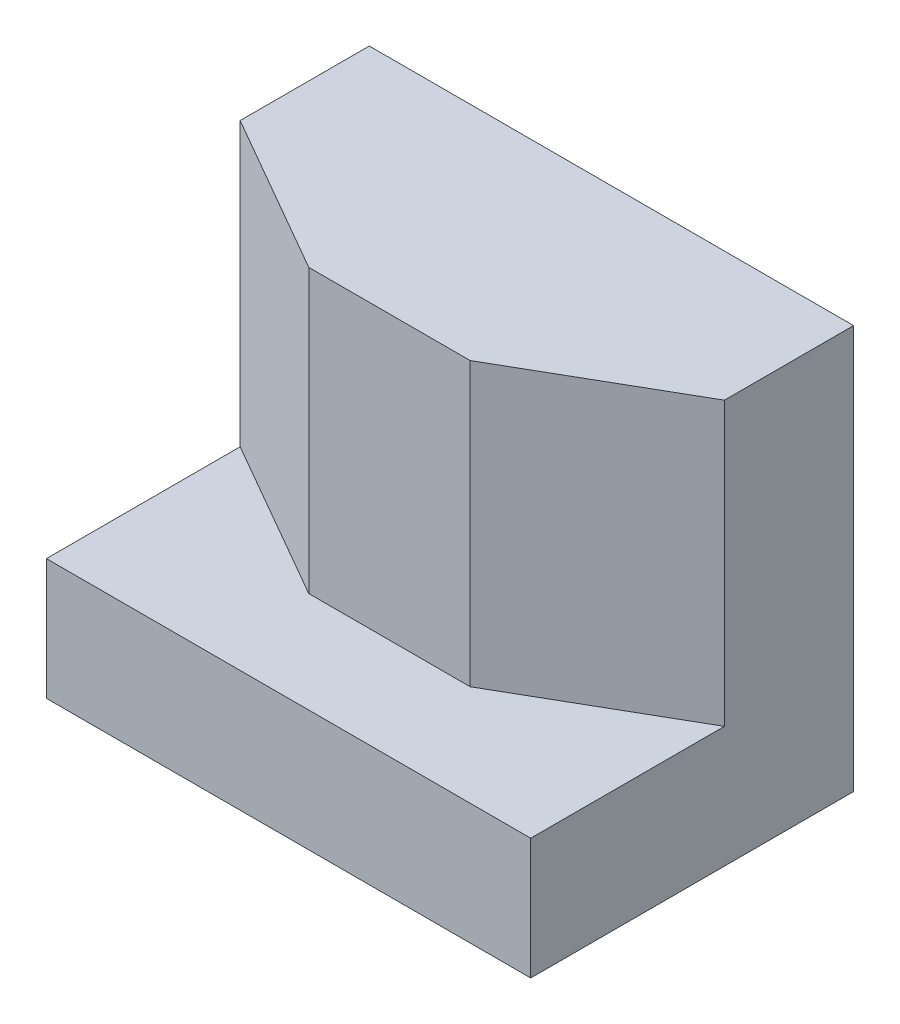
from build123d import *

# Parameters (mm, degrees)
SKETCH_1_W          = 120
SKETCH_1_H          = 80
EXTRUDE_1_DEPTH     = 100
CUT_EXTRUDE_1_DEPTH = 70


with BuildPart() as part:
    # Sketch 1 → Extrude 1 (new body)
    with BuildSketch(Plane(origin=(0, 0, 0), x_dir=(1, 0, 0), z_dir=(0, 1, 0))):
        Rectangle(SKETCH_1_W, SKETCH_1_H)
    extrude(amount=EXTRUDE_1_DEPTH)

    # Sketch 2 → Cut-Extrude 1 (cut)
    with BuildSketch(Plane(origin=(0, 100, 0), x_dir=(1, 0, 0), z_dir=(0, 1, 0))):
        Polygon((-60, 8), (-20, -15), (20, -15), (60, 8), (60, -40), (-60, -40), align=None)
    extrude(amount=-CUT_EXTRUDE_1_DEPTH, mode=Mode.SUBTRACT)


solid = part.part
